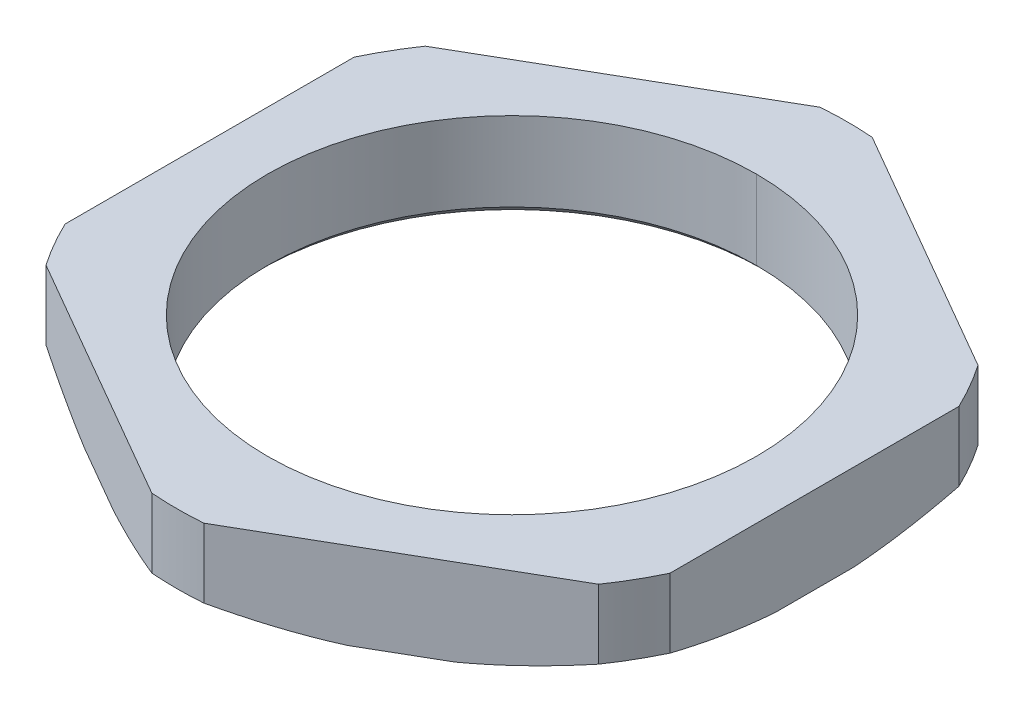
ISO-10303-21;
HEADER;
FILE_DESCRIPTION(('STEP AP214'),'2;1');
FILE_NAME('part.step','',(''),(''),'','','');
FILE_SCHEMA(('AUTOMOTIVE_DESIGN { 1 0 10303 214 1 1 1 1 }'));
ENDSEC;
DATA;
#1=APPLICATION_CONTEXT('core data for automotive mechanical design processes');
#2=APPLICATION_PROTOCOL_DEFINITION('international standard','automotive_design',2000,#1);
#3=PRODUCT_CONTEXT('',#1,'mechanical');
#4=PRODUCT('Part','Part','',(#3));
#5=PRODUCT_RELATED_PRODUCT_CATEGORY('part','',(#4));
#6=PRODUCT_DEFINITION_FORMATION('','',#4);
#7=PRODUCT_DEFINITION_CONTEXT('part definition',#1,'design');
#8=PRODUCT_DEFINITION('design','',#6,#7);
#9=PRODUCT_DEFINITION_SHAPE('','',#8);
#10=(LENGTH_UNIT() NAMED_UNIT(*) SI_UNIT(.MILLI.,.METRE.));
#11=(NAMED_UNIT(*) PLANE_ANGLE_UNIT() SI_UNIT($,.RADIAN.));
#12=(NAMED_UNIT(*) SI_UNIT($,.STERADIAN.) SOLID_ANGLE_UNIT());
#13=UNCERTAINTY_MEASURE_WITH_UNIT(LENGTH_MEASURE(1.E-05),#10,'distance_accuracy_value','');
#14=(GEOMETRIC_REPRESENTATION_CONTEXT(3) GLOBAL_UNCERTAINTY_ASSIGNED_CONTEXT((#13)) GLOBAL_UNIT_ASSIGNED_CONTEXT((#10,
#11,#12)) REPRESENTATION_CONTEXT('',''));
#15=CARTESIAN_POINT('',(0.,0.,0.));
#16=DIRECTION('',(0.,0.,1.));
#17=DIRECTION('',(1.,0.,0.));
#18=AXIS2_PLACEMENT_3D('',#15,#16,#17);
#19=CARTESIAN_POINT('',(0.,-27.1973321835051,0.));
#20=DIRECTION('',(0.,1.,0.));
#21=DIRECTION('',(0.,0.,1.));
#22=AXIS2_PLACEMENT_3D('',#19,#20,#21);
#23=CONICAL_SURFACE('',#22,50.,1.0471975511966);
#24=CARTESIAN_POINT('',(18.3610824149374,-38.6,-24.0402402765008));
#25=CARTESIAN_POINT('',(18.7382562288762,-38.5677652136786,-23.8224494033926));
#26=CARTESIAN_POINT('',(19.1150634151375,-38.5302174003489,-23.6048234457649));
#27=CARTESIAN_POINT('',(19.8688161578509,-38.4446695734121,-23.1695063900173));
#28=CARTESIAN_POINT('',(20.2457593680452,-38.396641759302,-22.9518166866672));
#29=CARTESIAN_POINT('',(21.001058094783,-38.2901413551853,-22.5157462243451));
#30=CARTESIAN_POINT('',(21.3794070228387,-38.2316033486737,-22.2973700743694));
#31=CARTESIAN_POINT('',(22.1386580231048,-38.1041345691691,-21.8591620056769));
#32=CARTESIAN_POINT('',(22.5195477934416,-38.0351057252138,-21.6393373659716));
#33=CARTESIAN_POINT('',(23.273149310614,-37.8889431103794,-21.2042687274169));
#34=CARTESIAN_POINT('',(23.6458862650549,-37.8119748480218,-20.9890126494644));
#35=CARTESIAN_POINT('',(24.3932664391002,-37.6486224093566,-20.5574335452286));
#36=CARTESIAN_POINT('',(24.7678970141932,-37.5621603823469,-20.34111812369));
#37=CARTESIAN_POINT('',(25.5199262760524,-37.3798473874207,-19.9069410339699));
#38=CARTESIAN_POINT('',(25.8973077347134,-37.2839004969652,-19.6890899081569));
#39=CARTESIAN_POINT('',(26.6556216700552,-37.0826361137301,-19.2513414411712));
#40=CARTESIAN_POINT('',(27.0365322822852,-36.9772085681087,-19.031456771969));
#41=CARTESIAN_POINT('',(27.4165967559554,-36.8679491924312,-18.8120366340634));
#42=B_SPLINE_CURVE_WITH_KNOTS('',3,(#24,#25,#26,#27,#28,#29,#30,#31,#32,#33,#34,#35,#36,#37,#38,
#39,#40,#41),.UNSPECIFIED.,.F.,.F.,(4,2,2,2,2,2,2,2,4),(0.,1.31014422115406,2.62380707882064,
3.94594918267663,5.28131229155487,6.59298565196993,7.91635666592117,9.2548364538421,
10.6115906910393),.UNSPECIFIED.);
#43=CARTESIAN_POINT('',(18.3610824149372,-38.6,-24.0402402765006));
#44=VERTEX_POINT('',#43);
#45=CARTESIAN_POINT('',(27.4165967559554,-36.8679491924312,-18.8120366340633));
#46=VERTEX_POINT('',#45);
#47=EDGE_CURVE('E304',#44,#46,#42,.T.);
#48=ORIENTED_EDGE('',*,*,#47,.T.);
#49=CARTESIAN_POINT('',(0.,-36.8679491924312,0.));
#50=DIRECTION('',(0.,-1.,0.));
#51=DIRECTION('',(0.,0.,1.));
#52=AXIS2_PLACEMENT_3D('',#49,#50,#51);
#53=CIRCLE('',#52,33.25);
#54=CARTESIAN_POINT('',(30.,-36.8679491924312,-14.3374509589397));
#55=VERTEX_POINT('',#54);
#56=EDGE_CURVE('E1083',#46,#55,#53,.T.);
#57=ORIENTED_EDGE('',*,*,#56,.T.);
#58=CARTESIAN_POINT('',(30.0000000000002,-36.8679491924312,-14.3374509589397));
#59=CARTESIAN_POINT('',(29.9999914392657,-36.9763099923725,-13.9022042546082));
#60=CARTESIAN_POINT('',(29.9999632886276,-37.080901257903,-13.466008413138));
#61=CARTESIAN_POINT('',(29.9999105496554,-37.2806547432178,-12.5975925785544));
#62=CARTESIAN_POINT('',(29.9998859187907,-37.375924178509,-12.1653972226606));
#63=CARTESIAN_POINT('',(29.999880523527,-37.5570436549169,-11.3040883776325));
#64=CARTESIAN_POINT('',(29.9998992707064,-37.642987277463,-10.8749946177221));
#65=CARTESIAN_POINT('',(29.9999648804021,-37.8054636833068,-10.0189396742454));
#66=CARTESIAN_POINT('',(30.0000114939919,-37.8820726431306,-9.59199296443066));
#67=CARTESIAN_POINT('',(29.9999881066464,-38.0288749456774,-8.72172961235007));
#68=CARTESIAN_POINT('',(29.9999139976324,-38.0987528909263,-8.27835961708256));
#69=CARTESIAN_POINT('',(29.9997833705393,-38.2277496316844,-7.39458875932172));
#70=CARTESIAN_POINT('',(29.9997266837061,-38.2869691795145,-6.95420263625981));
#71=CARTESIAN_POINT('',(29.9997260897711,-38.3946628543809,-6.07501032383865));
#72=CARTESIAN_POINT('',(29.9997814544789,-38.4432041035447,-5.63621237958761));
#73=CARTESIAN_POINT('',(29.9999052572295,-38.5296110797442,-4.75875783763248));
#74=CARTESIAN_POINT('',(29.9999736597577,-38.5675051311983,-4.32010402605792));
#75=CARTESIAN_POINT('',(30.0000000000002,-38.6,-3.88104367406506));
#76=B_SPLINE_CURVE_WITH_KNOTS('',3,(#58,#59,#60,#61,#62,#63,#64,#65,#66,#67,#68,#69,#70,#71,#72,
#73,#74,#75),.UNSPECIFIED.,.F.,.F.,(4,2,2,2,2,2,2,2,4),(0.,1.34559696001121,2.67323460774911,
3.98599636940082,5.28720306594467,6.63362056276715,7.96655250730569,9.29084993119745,
10.611590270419),.UNSPECIFIED.);
#77=CARTESIAN_POINT('',(30.,-38.6,-3.88104367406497));
#78=VERTEX_POINT('',#77);
#79=EDGE_CURVE('E220',#55,#78,#76,.T.);
#80=ORIENTED_EDGE('',*,*,#79,.T.);
#81=CARTESIAN_POINT('',(0.,-38.6,0.));
#82=DIRECTION('',(0.,1.,0.));
#83=DIRECTION('',(0.,0.,1.));
#84=AXIS2_PLACEMENT_3D('',#81,#82,#83);
#85=CIRCLE('',#84,30.25);
#86=EDGE_CURVE('E279',#78,#44,#85,.T.);
#87=ORIENTED_EDGE('',*,*,#86,.T.);
#88=EDGE_LOOP('',(#48,#57,#80,#87));
#89=FACE_BOUND('',#88,.T.);
#90=ADVANCED_FACE('F15',(#89),#23,.T.);
#91=CARTESIAN_POINT('',(0.,-27.1973321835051,0.));
#92=DIRECTION('',(0.,1.,0.));
#93=DIRECTION('',(0.,0.,1.));
#94=AXIS2_PLACEMENT_3D('',#91,#92,#93);
#95=CONICAL_SURFACE('',#94,50.,1.0471975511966);
#96=CARTESIAN_POINT('',(30.0000000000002,-38.6,3.88104367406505));
#97=CARTESIAN_POINT('',(29.9999744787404,-38.5677546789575,4.31672290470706));
#98=CARTESIAN_POINT('',(29.999929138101,-38.5301811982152,4.75200071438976));
#99=CARTESIAN_POINT('',(29.9998713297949,-38.4445478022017,5.62287583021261));
#100=CARTESIAN_POINT('',(29.999858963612,-38.3964560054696,6.05847000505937));
#101=CARTESIAN_POINT('',(29.9999409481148,-38.2897932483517,6.93140181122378));
#102=CARTESIAN_POINT('',(30.0000360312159,-38.2311526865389,7.36873091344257));
#103=CARTESIAN_POINT('',(30.0002158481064,-38.1034459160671,8.24651081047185));
#104=CARTESIAN_POINT('',(30.0003004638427,-38.0342775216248,8.68694670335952));
#105=CARTESIAN_POINT('',(30.0003087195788,-37.8879763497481,9.55757407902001));
#106=CARTESIAN_POINT('',(30.0002354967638,-37.8110272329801,9.98779650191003));
#107=CARTESIAN_POINT('',(30.0001063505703,-37.6477521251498,10.8503016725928));
#108=CARTESIAN_POINT('',(30.0000505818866,-37.5613509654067,11.2825701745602));
#109=CARTESIAN_POINT('',(29.999985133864,-37.379200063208,12.1501461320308));
#110=CARTESIAN_POINT('',(29.999975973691,-37.2833570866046,12.5854339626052));
#111=CARTESIAN_POINT('',(29.9999786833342,-37.082340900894,13.4599694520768));
#112=CARTESIAN_POINT('',(29.999990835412,-36.9770602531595,13.8991924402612));
#113=CARTESIAN_POINT('',(30.0000000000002,-36.8679491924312,14.3374509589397));
#114=B_SPLINE_CURVE_WITH_KNOTS('',3,(#96,#97,#98,#99,#100,#101,#102,#103,#104,#105,#106,#107,
#108,#109,#110,#111,#112,#113),.UNSPECIFIED.,.F.,.F.,(4,2,2,2,2,2,2,2,4),(0.,1.31056980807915,
2.62516846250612,3.9487822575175,5.28617624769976,6.59723374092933,7.91960194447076,
9.25666807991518,10.6115764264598),.UNSPECIFIED.);
#115=CARTESIAN_POINT('',(30.,-38.6,3.88104367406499));
#116=VERTEX_POINT('',#115);
#117=CARTESIAN_POINT('',(30.,-36.8679491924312,14.3374509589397));
#118=VERTEX_POINT('',#117);
#119=EDGE_CURVE('E202',#116,#118,#114,.T.);
#120=ORIENTED_EDGE('',*,*,#119,.T.);
#121=CARTESIAN_POINT('',(0.,-36.8679491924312,0.));
#122=DIRECTION('',(0.,-1.,0.));
#123=DIRECTION('',(0.,0.,1.));
#124=AXIS2_PLACEMENT_3D('',#121,#122,#123);
#125=CIRCLE('',#124,33.25);
#126=CARTESIAN_POINT('',(27.4165967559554,-36.8679491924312,18.8120366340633));
#127=VERTEX_POINT('',#126);
#128=EDGE_CURVE('E187',#118,#127,#125,.T.);
#129=ORIENTED_EDGE('',*,*,#128,.T.);
#130=CARTESIAN_POINT('',(27.4165967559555,-36.8679491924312,18.8120366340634));
#131=CARTESIAN_POINT('',(27.0383482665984,-36.9766864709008,19.0304085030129));
#132=CARTESIAN_POINT('',(26.6592620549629,-37.0816281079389,19.2492409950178));
#133=CARTESIAN_POINT('',(25.9045591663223,-37.2820151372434,19.6849070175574));
#134=CARTESIAN_POINT('',(25.5289640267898,-37.3775688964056,19.9017280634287));
#135=CARTESIAN_POINT('',(24.7804810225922,-37.5591899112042,20.3338586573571));
#136=CARTESIAN_POINT('',(24.4076101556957,-37.6453516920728,20.5491578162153));
#137=CARTESIAN_POINT('',(23.6637361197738,-37.8081976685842,20.9787104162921));
#138=CARTESIAN_POINT('',(23.2927454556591,-37.8849587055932,21.1929563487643));
#139=CARTESIAN_POINT('',(22.5390970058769,-38.0314930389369,21.6280490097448));
#140=CARTESIAN_POINT('',(22.1564006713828,-38.1010139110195,21.8489142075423));
#141=CARTESIAN_POINT('',(21.3935651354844,-38.2293681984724,22.2891884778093));
#142=CARTESIAN_POINT('',(21.0134384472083,-38.2883011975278,22.5085901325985));
#143=CARTESIAN_POINT('',(20.2545975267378,-38.3954933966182,22.9467065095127));
#144=CARTESIAN_POINT('',(19.8758899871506,-38.4438189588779,23.1654165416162));
#145=CARTESIAN_POINT('',(19.1186043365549,-38.5298652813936,23.6027767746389));
#146=CARTESIAN_POINT('',(18.7400285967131,-38.5676141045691,23.8214255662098));
#147=CARTESIAN_POINT('',(18.3610824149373,-38.6,24.0402402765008));
#148=B_SPLINE_CURVE_WITH_KNOTS('',3,(#130,#131,#132,#133,#134,#135,#136,#137,#138,#139,#140,
#141,#142,#143,#144,#145,#146,#147),.UNSPECIFIED.,.F.,.F.,(4,2,2,2,2,2,2,2,4),(0.,
1.35027160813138,2.68245754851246,3.99967535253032,5.30528327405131,6.64705256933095,
7.97545305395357,9.29528964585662,10.6115904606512),.UNSPECIFIED.);
#149=CARTESIAN_POINT('',(18.3610824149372,-38.6,24.0402402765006));
#150=VERTEX_POINT('',#149);
#151=EDGE_CURVE('E453',#127,#150,#148,.T.);
#152=ORIENTED_EDGE('',*,*,#151,.T.);
#153=CARTESIAN_POINT('',(0.,-38.6,0.));
#154=DIRECTION('',(0.,1.,0.));
#155=DIRECTION('',(0.,0.,1.));
#156=AXIS2_PLACEMENT_3D('',#153,#154,#155);
#157=CIRCLE('',#156,30.25);
#158=EDGE_CURVE('E206',#150,#116,#157,.T.);
#159=ORIENTED_EDGE('',*,*,#158,.T.);
#160=EDGE_LOOP('',(#120,#129,#152,#159));
#161=FACE_BOUND('',#160,.T.);
#162=ADVANCED_FACE('F204',(#161),#95,.T.);
#163=CARTESIAN_POINT('',(0.,-27.1973321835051,0.));
#164=DIRECTION('',(0.,1.,0.));
#165=DIRECTION('',(0.,0.,1.));
#166=AXIS2_PLACEMENT_3D('',#163,#164,#165);
#167=CONICAL_SURFACE('',#166,50.,1.0471975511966);
#168=CARTESIAN_POINT('',(2.58340324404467,-36.8679491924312,-33.1494875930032));
#169=CARTESIAN_POINT('',(2.96164307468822,-36.9766864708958,-32.9311007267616));
#170=CARTESIAN_POINT('',(3.34070067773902,-37.0816281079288,-32.7122186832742));
#171=CARTESIAN_POINT('',(4.09534996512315,-37.2820151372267,-32.2764598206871));
#172=CARTESIAN_POINT('',(4.4709200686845,-37.377568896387,-32.0595954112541));
#173=CARTESIAN_POINT('',(5.21939764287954,-37.5591899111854,-31.6274554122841));
#174=CARTESIAN_POINT('',(5.59228761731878,-37.6453516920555,-31.4121893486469));
#175=CARTESIAN_POINT('',(6.33622809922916,-37.8081976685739,-30.9827518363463));
#176=CARTESIAN_POINT('',(6.70726585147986,-37.8849587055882,-30.7685874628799));
#177=CARTESIAN_POINT('',(7.46089137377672,-38.0314930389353,-30.3334550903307));
#178=CARTESIAN_POINT('',(7.8435144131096,-38.1010139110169,-30.1124629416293));
#179=CARTESIAN_POINT('',(8.60622088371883,-38.2293681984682,-29.6719651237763));
#180=CARTESIAN_POINT('',(8.9862916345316,-38.2883011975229,-29.4524665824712));
#181=CARTESIAN_POINT('',(9.74513200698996,-38.3954933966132,-29.0143492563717));
#182=CARTESIAN_POINT('',(10.1238942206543,-38.4438189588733,-28.7957339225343));
#183=CARTESIAN_POINT('',(10.8813021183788,-38.5298652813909,-28.3585854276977));
#184=CARTESIAN_POINT('',(11.2599453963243,-38.5676141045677,-28.1400536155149));
#185=CARTESIAN_POINT('',(11.6389175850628,-38.6,-27.9212839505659));
#186=B_SPLINE_CURVE_WITH_KNOTS('',3,(#168,#169,#170,#171,#172,#173,#174,#175,#176,#177,#178,
#179,#180,#181,#182,#183,#184,#185),.UNSPECIFIED.,.F.,.F.,(4,2,2,2,2,2,2,2,4),(0.,1.35027160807,
2.68245754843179,3.99967535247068,5.3052832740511,6.64705256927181,7.97545305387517,
9.29528964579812,10.6115904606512),.UNSPECIFIED.);
#187=CARTESIAN_POINT('',(2.58340324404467,-36.8679491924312,-33.149487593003));
#188=VERTEX_POINT('',#187);
#189=CARTESIAN_POINT('',(11.6389175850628,-38.6,-27.9212839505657));
#190=VERTEX_POINT('',#189);
#191=EDGE_CURVE('E330',#188,#190,#186,.T.);
#192=ORIENTED_EDGE('',*,*,#191,.T.);
#193=CARTESIAN_POINT('',(0.,-38.6,0.));
#194=DIRECTION('',(0.,1.,0.));
#195=DIRECTION('',(0.,0.,1.));
#196=AXIS2_PLACEMENT_3D('',#193,#194,#195);
#197=CIRCLE('',#196,30.25);
#198=CARTESIAN_POINT('',(-11.6389175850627,-38.6,-27.9212839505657));
#199=VERTEX_POINT('',#198);
#200=EDGE_CURVE('E295',#190,#199,#197,.T.);
#201=ORIENTED_EDGE('',*,*,#200,.T.);
#202=CARTESIAN_POINT('',(-11.6389175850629,-38.6,-27.9212839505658));
#203=CARTESIAN_POINT('',(-11.2617182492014,-38.5677652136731,-28.1390306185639));
#204=CARTESIAN_POINT('',(-10.8848450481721,-38.530217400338,-28.3565422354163));
#205=CARTESIAN_POINT('',(-10.1309730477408,-38.4446695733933,-28.7916527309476));
#206=CARTESIAN_POINT('',(-9.75397662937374,-38.3966417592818,-29.0092502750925));
#207=CARTESIAN_POINT('',(-8.99867916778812,-38.2901413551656,-29.4453229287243));
#208=CARTESIAN_POINT('',(-8.62038541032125,-38.2316033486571,-29.6637946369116));
#209=CARTESIAN_POINT('',(-7.8612605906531,-38.1041345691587,-30.1022212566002));
#210=CARTESIAN_POINT('',(-7.4804419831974,-38.0351057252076,-30.3221691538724));
#211=CARTESIAN_POINT('',(-6.72686073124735,-37.8889431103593,-30.7572728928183));
#212=CARTESIAN_POINT('',(-6.35407502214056,-37.8119748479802,-30.9724445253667));
#213=CARTESIAN_POINT('',(-5.60662646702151,-37.6486224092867,-31.4039051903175));
#214=CARTESIAN_POINT('',(-5.23197652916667,-37.5621603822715,-31.6201870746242));
#215=CARTESIAN_POINT('',(-4.47995350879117,-37.3798473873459,-32.0543749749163));
#216=CARTESIAN_POINT('',(-4.1025981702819,-37.2839004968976,-32.2722713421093));
#217=CARTESIAN_POINT('',(-3.34433990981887,-37.0826361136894,-32.7101162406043));
#218=CARTESIAN_POINT('',(-2.96345889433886,-36.9772085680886,-32.9300521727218));
#219=CARTESIAN_POINT('',(-2.58340324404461,-36.8679491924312,-33.1494875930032));
#220=B_SPLINE_CURVE_WITH_KNOTS('',3,(#202,#203,#204,#205,#206,#207,#208,#209,#210,#211,#212,
#213,#214,#215,#216,#217,#218,#219),.UNSPECIFIED.,.F.,.F.,(4,2,2,2,2,2,2,2,4),(0.,
1.31014422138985,2.62380707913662,3.94594918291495,5.28131229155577,6.59298565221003,
7.91635666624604,9.25483645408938,10.6115906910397),.UNSPECIFIED.);
#221=CARTESIAN_POINT('',(-2.5834032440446,-36.8679491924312,-33.149487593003));
#222=VERTEX_POINT('',#221);
#223=EDGE_CURVE('E372',#199,#222,#220,.T.);
#224=ORIENTED_EDGE('',*,*,#223,.T.);
#225=CARTESIAN_POINT('',(0.,-36.8679491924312,0.));
#226=DIRECTION('',(0.,-1.,0.));
#227=DIRECTION('',(0.,0.,1.));
#228=AXIS2_PLACEMENT_3D('',#225,#226,#227);
#229=CIRCLE('',#228,33.25);
#230=EDGE_CURVE('E287',#222,#188,#229,.T.);
#231=ORIENTED_EDGE('',*,*,#230,.T.);
#232=EDGE_LOOP('',(#192,#201,#224,#231));
#233=FACE_BOUND('',#232,.T.);
#234=ADVANCED_FACE('F342',(#233),#167,.T.);
#235=CARTESIAN_POINT('',(0.,-27.1973321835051,0.));
#236=DIRECTION('',(0.,1.,0.));
#237=DIRECTION('',(0.,0.,1.));
#238=AXIS2_PLACEMENT_3D('',#235,#236,#237);
#239=CONICAL_SURFACE('',#238,50.,1.0471975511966);
#240=CARTESIAN_POINT('',(-27.4165967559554,-36.8679491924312,-18.8120366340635));
#241=CARTESIAN_POINT('',(-27.0383482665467,-36.9766864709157,-19.0304085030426));
#242=CARTESIAN_POINT('',(-26.6592620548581,-37.0816281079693,-19.2492409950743));
#243=CARTESIAN_POINT('',(-25.9045591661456,-37.2820151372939,-19.6849070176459));
#244=CARTESIAN_POINT('',(-25.5289640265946,-37.3775688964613,-19.9017280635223));
#245=CARTESIAN_POINT('',(-24.780481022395,-37.5591899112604,-20.3338586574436));
#246=CARTESIAN_POINT('',(-24.4076101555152,-37.6453516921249,-20.5491578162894));
#247=CARTESIAN_POINT('',(-23.6637361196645,-37.8081976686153,-20.9787104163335));
#248=CARTESIAN_POINT('',(-23.2927454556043,-37.8849587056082,-21.192956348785));
#249=CARTESIAN_POINT('',(-22.5390970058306,-38.0314930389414,-21.6280490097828));
#250=CARTESIAN_POINT('',(-22.1564006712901,-38.1010139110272,-21.8489142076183));
#251=CARTESIAN_POINT('',(-21.3935651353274,-38.2293681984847,-22.2891884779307));
#252=CARTESIAN_POINT('',(-21.0134384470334,-38.2883011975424,-22.5085901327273));
#253=CARTESIAN_POINT('',(-20.2545975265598,-38.3954933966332,-22.9467065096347));
#254=CARTESIAN_POINT('',(-19.8758899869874,-38.4438189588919,-23.165416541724));
#255=CARTESIAN_POINT('',(-19.1186043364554,-38.5298652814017,-23.6027767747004));
#256=CARTESIAN_POINT('',(-18.7400285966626,-38.5676141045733,-23.8214255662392));
#257=CARTESIAN_POINT('',(-18.3610824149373,-38.6,-24.0402402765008));
#258=B_SPLINE_CURVE_WITH_KNOTS('',3,(#240,#241,#242,#243,#244,#245,#246,#247,#248,#249,#250,
#251,#252,#253,#254,#255,#256,#257),.UNSPECIFIED.,.F.,.F.,(4,2,2,2,2,2,2,2,4),(0.,
1.3502716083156,2.68245754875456,3.99967535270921,5.3052832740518,6.64705256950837,
7.97545305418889,9.29528964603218,10.611590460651),.UNSPECIFIED.);
#259=CARTESIAN_POINT('',(-27.4165967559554,-36.8679491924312,-18.8120366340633));
#260=VERTEX_POINT('',#259);
#261=CARTESIAN_POINT('',(-18.3610824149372,-38.6,-24.0402402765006));
#262=VERTEX_POINT('',#261);
#263=EDGE_CURVE('E198',#260,#262,#258,.T.);
#264=ORIENTED_EDGE('',*,*,#263,.T.);
#265=CARTESIAN_POINT('',(0.,-38.6,0.));
#266=DIRECTION('',(0.,1.,0.));
#267=DIRECTION('',(0.,0.,1.));
#268=AXIS2_PLACEMENT_3D('',#265,#266,#267);
#269=CIRCLE('',#268,30.25);
#270=CARTESIAN_POINT('',(-30.,-38.6,-3.88104367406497));
#271=VERTEX_POINT('',#270);
#272=EDGE_CURVE('E684',#262,#271,#269,.T.);
#273=ORIENTED_EDGE('',*,*,#272,.T.);
#274=CARTESIAN_POINT('',(-30.0000000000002,-38.6,-3.88104367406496));
#275=CARTESIAN_POINT('',(-29.9999744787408,-38.5677546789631,-4.31672290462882));
#276=CARTESIAN_POINT('',(-29.9999291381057,-38.530181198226,-4.75200071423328));
#277=CARTESIAN_POINT('',(-29.9998713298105,-38.4445478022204,-5.62287582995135));
#278=CARTESIAN_POINT('',(-29.9998589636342,-38.3964560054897,-6.05847000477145));
#279=CARTESIAN_POINT('',(-29.999940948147,-38.2897932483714,-6.93140181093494));
#280=CARTESIAN_POINT('',(-30.0000360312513,-38.2311526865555,-7.36873091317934));
#281=CARTESIAN_POINT('',(-30.0002158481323,-38.1034459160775,-8.2465108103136));
#282=CARTESIAN_POINT('',(-30.0003004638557,-38.0342775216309,-8.68694670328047));
#283=CARTESIAN_POINT('',(-30.000308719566,-37.8879763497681,-9.55757407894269));
#284=CARTESIAN_POINT('',(-30.0002354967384,-37.8110272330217,-9.98779650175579));
#285=CARTESIAN_POINT('',(-30.0001063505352,-37.6477521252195,-10.8503016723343));
#286=CARTESIAN_POINT('',(-30.0000505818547,-37.5613509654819,-11.2825701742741));
#287=CARTESIAN_POINT('',(-29.9999851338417,-37.3792000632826,-12.1501461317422));
#288=CARTESIAN_POINT('',(-29.9999759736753,-37.283357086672,-12.5854339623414));
#289=CARTESIAN_POINT('',(-29.9999786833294,-37.0823409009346,-13.4599694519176));
#290=CARTESIAN_POINT('',(-29.9999908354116,-36.9770602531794,-13.8991924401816));
#291=CARTESIAN_POINT('',(-30.0000000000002,-36.8679491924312,-14.3374509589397));
#292=B_SPLINE_CURVE_WITH_KNOTS('',3,(#274,#275,#276,#277,#278,#279,#280,#281,#282,#283,#284,
#285,#286,#287,#288,#289,#290,#291),.UNSPECIFIED.,.F.,.F.,(4,2,2,2,2,2,2,2,4),(0.,
1.31056980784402,2.62516846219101,3.94878225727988,5.28617624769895,6.59723374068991,
7.91960194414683,9.25666807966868,10.6115764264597),.UNSPECIFIED.);
#293=CARTESIAN_POINT('',(-30.,-36.8679491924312,-14.3374509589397));
#294=VERTEX_POINT('',#293);
#295=EDGE_CURVE('E691',#271,#294,#292,.T.);
#296=ORIENTED_EDGE('',*,*,#295,.T.);
#297=CARTESIAN_POINT('',(0.,-36.8679491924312,0.));
#298=DIRECTION('',(0.,-1.,0.));
#299=DIRECTION('',(0.,0.,1.));
#300=AXIS2_PLACEMENT_3D('',#297,#298,#299);
#301=CIRCLE('',#300,33.25);
#302=EDGE_CURVE('E665',#294,#260,#301,.T.);
#303=ORIENTED_EDGE('',*,*,#302,.T.);
#304=EDGE_LOOP('',(#264,#273,#296,#303));
#305=FACE_BOUND('',#304,.T.);
#306=ADVANCED_FACE('F351',(#305),#239,.T.);
#307=CARTESIAN_POINT('',(0.,-27.1973321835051,0.));
#308=DIRECTION('',(0.,1.,0.));
#309=DIRECTION('',(0.,0.,1.));
#310=AXIS2_PLACEMENT_3D('',#307,#308,#309);
#311=CONICAL_SURFACE('',#310,50.,1.0471975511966);
#312=DIRECTION('',(0.,0.5,0.866025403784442));
#313=VECTOR('',#312,1.);
#314=CARTESIAN_POINT('',(0.,-27.1973321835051,50.));
#315=LINE('',#314,#313);
#316=CARTESIAN_POINT('',(0.,-38.6,30.25));
#317=VERTEX_POINT('',#316);
#318=CARTESIAN_POINT('',(0.,-36.8679491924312,33.25));
#319=VERTEX_POINT('',#318);
#320=EDGE_CURVE('E503',#317,#319,#315,.T.);
#321=ORIENTED_EDGE('',*,*,#320,.F.);
#322=CARTESIAN_POINT('',(0.,-38.6,0.));
#323=DIRECTION('',(0.,1.,0.));
#324=DIRECTION('',(0.,0.,1.));
#325=AXIS2_PLACEMENT_3D('',#322,#323,#324);
#326=CIRCLE('',#325,30.25);
#327=CARTESIAN_POINT('',(11.6389175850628,-38.6,27.9212839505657));
#328=VERTEX_POINT('',#327);
#329=EDGE_CURVE('E471',#317,#328,#326,.T.);
#330=ORIENTED_EDGE('',*,*,#329,.T.);
#331=CARTESIAN_POINT('',(11.6389175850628,-38.6,27.9212839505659));
#332=CARTESIAN_POINT('',(11.2617182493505,-38.5677652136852,28.1390306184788));
#333=CARTESIAN_POINT('',(10.8848450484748,-38.5302174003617,28.3565422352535));
#334=CARTESIAN_POINT('',(10.1309730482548,-38.4446695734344,28.7916527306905));
#335=CARTESIAN_POINT('',(9.7539766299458,-38.396641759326,29.0092502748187));
#336=CARTESIAN_POINT('',(8.99867916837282,-38.2901413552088,29.4453229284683));
#337=CARTESIAN_POINT('',(8.62038541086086,-38.2316033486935,29.6637946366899));
#338=CARTESIAN_POINT('',(7.86126059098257,-38.1041345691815,30.1022212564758));
#339=CARTESIAN_POINT('',(7.48044198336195,-38.0351057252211,30.3221691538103));
#340=CARTESIAN_POINT('',(6.7268607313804,-37.8889431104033,30.7572728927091));
#341=CARTESIAN_POINT('',(6.35407502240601,-37.8119748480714,30.9724445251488));
#342=CARTESIAN_POINT('',(5.60662646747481,-37.6486224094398,31.4039051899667));
#343=CARTESIAN_POINT('',(5.23197652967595,-37.5621603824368,31.6201870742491));
#344=CARTESIAN_POINT('',(4.4799535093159,-37.3798473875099,32.0543749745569));
#345=CARTESIAN_POINT('',(4.10259817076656,-37.2839004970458,32.2722713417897));
#346=CARTESIAN_POINT('',(3.34433991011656,-37.0826361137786,32.7101162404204));
#347=CARTESIAN_POINT('',(2.96345889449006,-36.9772085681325,32.9300521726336));
#348=CARTESIAN_POINT('',(2.58340324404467,-36.8679491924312,33.1494875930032));
#349=B_SPLINE_CURVE_WITH_KNOTS('',3,(#331,#332,#333,#334,#335,#336,#337,#338,#339,#340,#341,
#342,#343,#344,#345,#346,#347,#348),.UNSPECIFIED.,.F.,.F.,(4,2,2,2,2,2,2,2,4),(0.,
1.31014422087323,2.62380707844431,3.9459491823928,5.28131229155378,6.59298565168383,
7.91635666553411,9.25483645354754,10.6115906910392),.UNSPECIFIED.);
#350=CARTESIAN_POINT('',(2.58340324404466,-36.8679491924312,33.149487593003));
#351=VERTEX_POINT('',#350);
#352=EDGE_CURVE('E199',#328,#351,#349,.T.);
#353=ORIENTED_EDGE('',*,*,#352,.T.);
#354=CARTESIAN_POINT('',(0.,-36.8679491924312,0.));
#355=DIRECTION('',(0.,-1.,0.));
#356=DIRECTION('',(0.,0.,1.));
#357=AXIS2_PLACEMENT_3D('',#354,#355,#356);
#358=CIRCLE('',#357,33.25);
#359=EDGE_CURVE('E212',#351,#319,#358,.T.);
#360=ORIENTED_EDGE('',*,*,#359,.T.);
#361=EDGE_LOOP('',(#321,#330,#353,#360));
#362=FACE_BOUND('',#361,.T.);
#363=ADVANCED_FACE('F417',(#362),#311,.T.);
#364=CARTESIAN_POINT('',(0.,-27.1973321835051,0.));
#365=DIRECTION('',(0.,1.,0.));
#366=DIRECTION('',(0.,0.,1.));
#367=AXIS2_PLACEMENT_3D('',#364,#365,#366);
#368=CONICAL_SURFACE('',#367,50.,1.0471975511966);
#369=CARTESIAN_POINT('',(-30.0000000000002,-36.8679491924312,14.3374509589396));
#370=CARTESIAN_POINT('',(-29.9999914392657,-36.9763099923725,13.9022042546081));
#371=CARTESIAN_POINT('',(-29.9999632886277,-37.080901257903,13.4660084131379));
#372=CARTESIAN_POINT('',(-29.9999105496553,-37.2806547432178,12.5975925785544));
#373=CARTESIAN_POINT('',(-29.9998859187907,-37.375924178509,12.1653972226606));
#374=CARTESIAN_POINT('',(-29.999880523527,-37.5570436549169,11.3040883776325));
#375=CARTESIAN_POINT('',(-29.9998992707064,-37.642987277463,10.8749946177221));
#376=CARTESIAN_POINT('',(-29.9999648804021,-37.8054636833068,10.0189396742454));
#377=CARTESIAN_POINT('',(-30.0000114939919,-37.8820726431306,9.5919929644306));
#378=CARTESIAN_POINT('',(-29.9999881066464,-38.0288749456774,8.72172961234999));
#379=CARTESIAN_POINT('',(-29.9999139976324,-38.0987528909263,8.27835961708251));
#380=CARTESIAN_POINT('',(-29.9997833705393,-38.2277496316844,7.3945887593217));
#381=CARTESIAN_POINT('',(-29.9997266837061,-38.2869691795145,6.95420263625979));
#382=CARTESIAN_POINT('',(-29.9997260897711,-38.3946628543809,6.07501032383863));
#383=CARTESIAN_POINT('',(-29.9997814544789,-38.4432041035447,5.63621237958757));
#384=CARTESIAN_POINT('',(-29.9999052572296,-38.5296110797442,4.75875783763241));
#385=CARTESIAN_POINT('',(-29.9999736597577,-38.5675051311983,4.32010402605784));
#386=CARTESIAN_POINT('',(-30.0000000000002,-38.6,3.88104367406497));
#387=B_SPLINE_CURVE_WITH_KNOTS('',3,(#369,#370,#371,#372,#373,#374,#375,#376,#377,#378,#379,
#380,#381,#382,#383,#384,#385,#386),.UNSPECIFIED.,.F.,.F.,(4,2,2,2,2,2,2,2,4),(0.,
1.34559696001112,2.67323460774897,3.98599636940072,5.28720306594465,6.63362056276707,
7.96655250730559,9.2908499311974,10.6115902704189),.UNSPECIFIED.);
#388=CARTESIAN_POINT('',(-30.,-36.8679491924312,14.3374509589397));
#389=VERTEX_POINT('',#388);
#390=CARTESIAN_POINT('',(-30.,-38.6,3.88104367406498));
#391=VERTEX_POINT('',#390);
#392=EDGE_CURVE('E676',#389,#391,#387,.T.);
#393=ORIENTED_EDGE('',*,*,#392,.T.);
#394=CARTESIAN_POINT('',(0.,-38.6,0.));
#395=DIRECTION('',(0.,1.,0.));
#396=DIRECTION('',(0.,0.,1.));
#397=AXIS2_PLACEMENT_3D('',#394,#395,#396);
#398=CIRCLE('',#397,30.25);
#399=CARTESIAN_POINT('',(-18.3610824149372,-38.6,24.0402402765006));
#400=VERTEX_POINT('',#399);
#401=EDGE_CURVE('E613',#391,#400,#398,.T.);
#402=ORIENTED_EDGE('',*,*,#401,.T.);
#403=CARTESIAN_POINT('',(-18.3610824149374,-38.6,24.0402402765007));
#404=CARTESIAN_POINT('',(-18.7382562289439,-38.5677652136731,23.8224494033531));
#405=CARTESIAN_POINT('',(-19.1150634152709,-38.530217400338,23.6048234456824));
#406=CARTESIAN_POINT('',(-19.8688161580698,-38.4446695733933,23.1695063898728));
#407=CARTESIAN_POINT('',(-20.2457593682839,-38.3966417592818,22.9518166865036));
#408=CARTESIAN_POINT('',(-21.0010580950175,-38.2901413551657,22.5157462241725));
#409=CARTESIAN_POINT('',(-21.3794070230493,-38.2316033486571,22.2973700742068));
#410=CARTESIAN_POINT('',(-22.1386580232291,-38.1041345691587,21.8591620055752));
#411=CARTESIAN_POINT('',(-22.5195477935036,-38.0351057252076,21.6393373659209));
#412=CARTESIAN_POINT('',(-23.2731493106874,-37.8889431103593,21.2042687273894));
#413=CARTESIAN_POINT('',(-23.6458862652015,-37.8119748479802,20.9890126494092));
#414=CARTESIAN_POINT('',(-24.3932664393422,-37.6486224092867,20.5574335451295));
#415=CARTESIAN_POINT('',(-24.7678970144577,-37.5621603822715,20.3411181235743));
#416=CARTESIAN_POINT('',(-25.5199262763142,-37.3798473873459,19.9069410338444));
#417=CARTESIAN_POINT('',(-25.8973077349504,-37.2839004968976,19.6890899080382));
#418=CARTESIAN_POINT('',(-26.6556216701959,-37.0826361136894,19.2513414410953));
#419=CARTESIAN_POINT('',(-27.0365322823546,-36.9772085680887,19.0314567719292));
#420=CARTESIAN_POINT('',(-27.4165967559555,-36.8679491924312,18.8120366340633));
#421=B_SPLINE_CURVE_WITH_KNOTS('',3,(#403,#404,#405,#406,#407,#408,#409,#410,#411,#412,#413,
#414,#415,#416,#417,#418,#419,#420),.UNSPECIFIED.,.F.,.F.,(4,2,2,2,2,2,2,2,4),(0.,
1.31014422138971,2.62380707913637,3.94594918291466,5.28131229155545,6.59298565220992,
7.91635666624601,9.25483645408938,10.6115906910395),.UNSPECIFIED.);
#422=CARTESIAN_POINT('',(-27.4165967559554,-36.8679491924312,18.8120366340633));
#423=VERTEX_POINT('',#422);
#424=EDGE_CURVE('E597',#400,#423,#421,.T.);
#425=ORIENTED_EDGE('',*,*,#424,.T.);
#426=CARTESIAN_POINT('',(0.,-36.8679491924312,0.));
#427=DIRECTION('',(0.,-1.,0.));
#428=DIRECTION('',(0.,0.,1.));
#429=AXIS2_PLACEMENT_3D('',#426,#427,#428);
#430=CIRCLE('',#429,33.25);
#431=EDGE_CURVE('E26',#423,#389,#430,.T.);
#432=ORIENTED_EDGE('',*,*,#431,.T.);
#433=EDGE_LOOP('',(#393,#402,#425,#432));
#434=FACE_BOUND('',#433,.T.);
#435=ADVANCED_FACE('F426',(#434),#368,.T.);
#436=CARTESIAN_POINT('',(0.,-37.85,0.));
#437=DIRECTION('',(0.,-1.,0.));
#438=DIRECTION('',(0.,0.,-1.));
#439=AXIS2_PLACEMENT_3D('',#436,#437,#438);
#440=CONICAL_SURFACE('',#439,24.25,0.785398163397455);
#441=DIRECTION('',(0.,-0.707106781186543,0.707106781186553));
#442=VECTOR('',#441,1.);
#443=CARTESIAN_POINT('',(0.,-37.85,24.25));
#444=LINE('',#443,#442);
#445=CARTESIAN_POINT('',(0.,-37.85,24.25));
#446=VERTEX_POINT('',#445);
#447=CARTESIAN_POINT('',(0.,-38.6,25.));
#448=VERTEX_POINT('',#447);
#449=EDGE_CURVE('E536',#446,#448,#444,.T.);
#450=ORIENTED_EDGE('',*,*,#449,.F.);
#451=CARTESIAN_POINT('',(0.,-37.85,0.));
#452=DIRECTION('',(0.,-1.,0.));
#453=DIRECTION('',(0.,0.,1.));
#454=AXIS2_PLACEMENT_3D('',#451,#452,#453);
#455=CIRCLE('',#454,24.25);
#456=CARTESIAN_POINT('',(0.,-37.85,-24.25));
#457=VERTEX_POINT('',#456);
#458=EDGE_CURVE('E10',#457,#446,#455,.T.);
#459=ORIENTED_EDGE('',*,*,#458,.F.);
#460=DIRECTION('',(0.,-0.707106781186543,-0.707106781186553));
#461=VECTOR('',#460,1.);
#462=CARTESIAN_POINT('',(0.,-37.85,-24.25));
#463=LINE('',#462,#461);
#464=CARTESIAN_POINT('',(0.,-38.6,-25.));
#465=VERTEX_POINT('',#464);
#466=EDGE_CURVE('E545',#457,#465,#463,.T.);
#467=ORIENTED_EDGE('',*,*,#466,.T.);
#468=CARTESIAN_POINT('',(0.,-38.6,0.));
#469=DIRECTION('',(0.,1.,0.));
#470=DIRECTION('',(0.,0.,1.));
#471=AXIS2_PLACEMENT_3D('',#468,#469,#470);
#472=CIRCLE('',#471,25.);
#473=EDGE_CURVE('E278',#448,#465,#472,.T.);
#474=ORIENTED_EDGE('',*,*,#473,.F.);
#475=EDGE_LOOP('',(#450,#459,#467,#474));
#476=FACE_BOUND('',#475,.T.);
#477=ADVANCED_FACE('F807',(#476),#440,.F.);
#478=CARTESIAN_POINT('',(0.,-38.6,0.));
#479=DIRECTION('',(0.,1.,0.));
#480=DIRECTION('',(0.,0.,1.));
#481=AXIS2_PLACEMENT_3D('',#478,#479,#480);
#482=CYLINDRICAL_SURFACE('',#481,24.25);
#483=DIRECTION('',(0.,1.,0.));
#484=VECTOR('',#483,1.);
#485=CARTESIAN_POINT('',(0.,-38.6,-24.25));
#486=LINE('',#485,#484);
#487=CARTESIAN_POINT('',(0.,-30.,-24.25));
#488=VERTEX_POINT('',#487);
#489=EDGE_CURVE('E546',#457,#488,#486,.T.);
#490=ORIENTED_EDGE('',*,*,#489,.F.);
#491=ORIENTED_EDGE('',*,*,#458,.T.);
#492=DIRECTION('',(0.,1.,0.));
#493=VECTOR('',#492,1.);
#494=CARTESIAN_POINT('',(0.,-38.6,24.25));
#495=LINE('',#494,#493);
#496=CARTESIAN_POINT('',(0.,-30.,24.25));
#497=VERTEX_POINT('',#496);
#498=EDGE_CURVE('E554',#446,#497,#495,.T.);
#499=ORIENTED_EDGE('',*,*,#498,.T.);
#500=CARTESIAN_POINT('',(0.,-30.,0.));
#501=DIRECTION('',(0.,1.,0.));
#502=DIRECTION('',(0.,0.,1.));
#503=AXIS2_PLACEMENT_3D('',#500,#501,#502);
#504=CIRCLE('',#503,24.25);
#505=EDGE_CURVE('E591',#497,#488,#504,.T.);
#506=ORIENTED_EDGE('',*,*,#505,.T.);
#507=EDGE_LOOP('',(#490,#491,#499,#506));
#508=FACE_BOUND('',#507,.T.);
#509=ADVANCED_FACE('F855',(#508),#482,.F.);
#510=CARTESIAN_POINT('',(0.,-38.6,0.));
#511=DIRECTION('',(0.,1.,0.));
#512=DIRECTION('',(0.,0.,-1.));
#513=AXIS2_PLACEMENT_3D('',#510,#511,#512);
#514=CYLINDRICAL_SURFACE('',#513,33.25);
#515=ORIENTED_EDGE('',*,*,#431,.F.);
#516=DIRECTION('',(0.,1.,0.));
#517=VECTOR('',#516,1.);
#518=CARTESIAN_POINT('',(-27.4165967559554,-38.6,18.8120366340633));
#519=LINE('',#518,#517);
#520=CARTESIAN_POINT('',(-27.4165967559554,-30.,18.8120366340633));
#521=VERTEX_POINT('',#520);
#522=EDGE_CURVE('E694',#423,#521,#519,.T.);
#523=ORIENTED_EDGE('',*,*,#522,.T.);
#524=CARTESIAN_POINT('',(0.,-30.,0.));
#525=DIRECTION('',(0.,-1.,0.));
#526=DIRECTION('',(0.,0.,-1.));
#527=AXIS2_PLACEMENT_3D('',#524,#525,#526);
#528=CIRCLE('',#527,33.25);
#529=CARTESIAN_POINT('',(-30.,-30.,14.3374509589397));
#530=VERTEX_POINT('',#529);
#531=EDGE_CURVE('E527',#521,#530,#528,.T.);
#532=ORIENTED_EDGE('',*,*,#531,.T.);
#533=DIRECTION('',(0.,1.,0.));
#534=VECTOR('',#533,1.);
#535=CARTESIAN_POINT('',(-30.,-38.6,14.3374509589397));
#536=LINE('',#535,#534);
#537=EDGE_CURVE('E695',#389,#530,#536,.T.);
#538=ORIENTED_EDGE('',*,*,#537,.F.);
#539=EDGE_LOOP('',(#515,#523,#532,#538));
#540=FACE_BOUND('',#539,.T.);
#541=ADVANCED_FACE('F624',(#540),#514,.T.);
#542=CARTESIAN_POINT('',(-27.4165967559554,-38.6,18.8120366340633));
#543=DIRECTION('',(0.5,0.,-0.866025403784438));
#544=DIRECTION('',(0.,1.,0.));
#545=AXIS2_PLACEMENT_3D('',#542,#543,#544);
#546=PLANE('',#545);
#547=CARTESIAN_POINT('',(-2.58340324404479,-36.8679491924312,33.1494875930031));
#548=CARTESIAN_POINT('',(-2.96164307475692,-36.9766864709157,32.9311007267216));
#549=CARTESIAN_POINT('',(-3.3407006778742,-37.0816281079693,32.7122186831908));
#550=CARTESIAN_POINT('',(-4.09534996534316,-37.2820151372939,32.2764598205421));
#551=CARTESIAN_POINT('',(-4.47092006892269,-37.3775688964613,32.0595954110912));
#552=CARTESIAN_POINT('',(-5.21939764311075,-37.5591899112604,31.6274554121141));
#553=CARTESIAN_POINT('',(-5.59228761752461,-37.6453516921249,31.4121893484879));
#554=CARTESIAN_POINT('',(-6.33622809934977,-37.8081976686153,30.9827518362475));
#555=CARTESIAN_POINT('',(-6.70726585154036,-37.8849587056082,30.7685874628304));
#556=CARTESIAN_POINT('',(-7.46089137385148,-38.0314930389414,30.3334550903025));
#557=CARTESIAN_POINT('',(-7.84351441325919,-38.1010139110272,30.112462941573));
#558=CARTESIAN_POINT('',(-8.60622088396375,-38.2293681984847,29.6719651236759));
#559=CARTESIAN_POINT('',(-8.98629163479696,-38.2883011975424,29.4524665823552));
#560=CARTESIAN_POINT('',(-9.74513200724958,-38.3954933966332,29.0143492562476));
#561=CARTESIAN_POINT('',(-10.1238942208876,-38.4438189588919,28.7957339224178));
#562=CARTESIAN_POINT('',(-10.8813021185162,-38.5298652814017,28.3585854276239));
#563=CARTESIAN_POINT('',(-11.259945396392,-38.5676141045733,28.1400536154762));
#564=CARTESIAN_POINT('',(-11.6389175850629,-38.6,27.9212839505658));
#565=B_SPLINE_CURVE_WITH_KNOTS('',3,(#547,#548,#549,#550,#551,#552,#553,#554,#555,#556,#557,
#558,#559,#560,#561,#562,#563,#564),.UNSPECIFIED.,.F.,.F.,(4,2,2,2,2,2,2,2,4),(0.,
1.3502716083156,2.68245754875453,3.99967535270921,5.30528327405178,6.64705256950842,
7.97545305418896,9.29528964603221,10.611590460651),.UNSPECIFIED.);
#566=CARTESIAN_POINT('',(-2.58340324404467,-36.8679491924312,33.149487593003));
#567=VERTEX_POINT('',#566);
#568=CARTESIAN_POINT('',(-11.6389175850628,-38.6,27.9212839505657));
#569=VERTEX_POINT('',#568);
#570=EDGE_CURVE('E513',#567,#569,#565,.T.);
#571=ORIENTED_EDGE('',*,*,#570,.F.);
#572=DIRECTION('',(0.,1.,0.));
#573=VECTOR('',#572,1.);
#574=CARTESIAN_POINT('',(-2.58340324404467,-38.6,33.149487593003));
#575=LINE('',#574,#573);
#576=CARTESIAN_POINT('',(-2.58340324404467,-30.,33.149487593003));
#577=VERTEX_POINT('',#576);
#578=EDGE_CURVE('E490',#567,#577,#575,.T.);
#579=ORIENTED_EDGE('',*,*,#578,.T.);
#580=DIRECTION('',(-0.866025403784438,0.,-0.5));
#581=VECTOR('',#580,1.);
#582=CARTESIAN_POINT('',(-27.4165967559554,-30.,18.8120366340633));
#583=LINE('',#582,#581);
#584=EDGE_CURVE('E531',#577,#521,#583,.T.);
#585=ORIENTED_EDGE('',*,*,#584,.T.);
#586=ORIENTED_EDGE('',*,*,#522,.F.);
#587=ORIENTED_EDGE('',*,*,#424,.F.);
#588=DIRECTION('',(-0.866025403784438,0.,-0.5));
#589=VECTOR('',#588,1.);
#590=CARTESIAN_POINT('',(-27.4165967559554,-38.6,18.8120366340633));
#591=LINE('',#590,#589);
#592=EDGE_CURVE('E479',#569,#400,#591,.T.);
#593=ORIENTED_EDGE('',*,*,#592,.F.);
#594=EDGE_LOOP('',(#571,#579,#585,#586,#587,#593));
#595=FACE_BOUND('',#594,.T.);
#596=ADVANCED_FACE('F615',(#595),#546,.F.);
#597=CARTESIAN_POINT('',(-30.,-38.6,-14.3374509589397));
#598=DIRECTION('',(1.,0.,0.));
#599=DIRECTION('',(0.,0.,-1.));
#600=AXIS2_PLACEMENT_3D('',#597,#598,#599);
#601=PLANE('',#600);
#602=ORIENTED_EDGE('',*,*,#392,.F.);
#603=ORIENTED_EDGE('',*,*,#537,.T.);
#604=DIRECTION('',(0.,0.,1.));
#605=VECTOR('',#604,1.);
#606=CARTESIAN_POINT('',(-30.,-30.,-14.3374509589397));
#607=LINE('',#606,#605);
#608=CARTESIAN_POINT('',(-30.,-30.,-14.3374509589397));
#609=VERTEX_POINT('',#608);
#610=EDGE_CURVE('E532',#609,#530,#607,.T.);
#611=ORIENTED_EDGE('',*,*,#610,.F.);
#612=DIRECTION('',(0.,1.,0.));
#613=VECTOR('',#612,1.);
#614=CARTESIAN_POINT('',(-30.,-38.6,-14.3374509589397));
#615=LINE('',#614,#613);
#616=EDGE_CURVE('E668',#294,#609,#615,.T.);
#617=ORIENTED_EDGE('',*,*,#616,.F.);
#618=ORIENTED_EDGE('',*,*,#295,.F.);
#619=DIRECTION('',(0.,0.,1.));
#620=VECTOR('',#619,1.);
#621=CARTESIAN_POINT('',(-30.,-38.6,-14.3374509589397));
#622=LINE('',#621,#620);
#623=EDGE_CURVE('E680',#271,#391,#622,.T.);
#624=ORIENTED_EDGE('',*,*,#623,.T.);
#625=EDGE_LOOP('',(#602,#603,#611,#617,#618,#624));
#626=FACE_BOUND('',#625,.T.);
#627=ADVANCED_FACE('F352',(#626),#601,.F.);
#628=CARTESIAN_POINT('',(0.,-38.6,0.));
#629=DIRECTION('',(0.,1.,0.));
#630=DIRECTION('',(0.,0.,1.));
#631=AXIS2_PLACEMENT_3D('',#628,#629,#630);
#632=CYLINDRICAL_SURFACE('',#631,33.25);
#633=ORIENTED_EDGE('',*,*,#302,.F.);
#634=ORIENTED_EDGE('',*,*,#616,.T.);
#635=CARTESIAN_POINT('',(0.,-30.,0.));
#636=DIRECTION('',(0.,1.,0.));
#637=DIRECTION('',(0.,0.,1.));
#638=AXIS2_PLACEMENT_3D('',#635,#636,#637);
#639=CIRCLE('',#638,33.25);
#640=CARTESIAN_POINT('',(-27.4165967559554,-30.,-18.8120366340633));
#641=VERTEX_POINT('',#640);
#642=EDGE_CURVE('E525',#641,#609,#639,.T.);
#643=ORIENTED_EDGE('',*,*,#642,.F.);
#644=DIRECTION('',(0.,1.,0.));
#645=VECTOR('',#644,1.);
#646=CARTESIAN_POINT('',(-27.4165967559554,-38.6,-18.8120366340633));
#647=LINE('',#646,#645);
#648=EDGE_CURVE('E397',#260,#641,#647,.T.);
#649=ORIENTED_EDGE('',*,*,#648,.F.);
#650=EDGE_LOOP('',(#633,#634,#643,#649));
#651=FACE_BOUND('',#650,.T.);
#652=ADVANCED_FACE('F386',(#651),#632,.T.);
#653=CARTESIAN_POINT('',(-27.4165967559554,-38.6,-18.8120366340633));
#654=DIRECTION('',(0.5,0.,0.866025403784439));
#655=DIRECTION('',(0.,-1.,0.));
#656=AXIS2_PLACEMENT_3D('',#653,#654,#655);
#657=PLANE('',#656);
#658=ORIENTED_EDGE('',*,*,#263,.F.);
#659=ORIENTED_EDGE('',*,*,#648,.T.);
#660=DIRECTION('',(-0.866025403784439,0.,0.5));
#661=VECTOR('',#660,1.);
#662=CARTESIAN_POINT('',(-27.4165967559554,-30.,-18.8120366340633));
#663=LINE('',#662,#661);
#664=CARTESIAN_POINT('',(-2.58340324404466,-30.,-33.149487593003));
#665=VERTEX_POINT('',#664);
#666=EDGE_CURVE('E562',#665,#641,#663,.T.);
#667=ORIENTED_EDGE('',*,*,#666,.F.);
#668=DIRECTION('',(0.,1.,0.));
#669=VECTOR('',#668,1.);
#670=CARTESIAN_POINT('',(-2.58340324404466,-38.6,-33.149487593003));
#671=LINE('',#670,#669);
#672=EDGE_CURVE('E1091',#222,#665,#671,.T.);
#673=ORIENTED_EDGE('',*,*,#672,.F.);
#674=ORIENTED_EDGE('',*,*,#223,.F.);
#675=DIRECTION('',(-0.866025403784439,0.,0.5));
#676=VECTOR('',#675,1.);
#677=CARTESIAN_POINT('',(-27.4165967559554,-38.6,-18.8120366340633));
#678=LINE('',#677,#676);
#679=EDGE_CURVE('E689',#199,#262,#678,.T.);
#680=ORIENTED_EDGE('',*,*,#679,.T.);
#681=EDGE_LOOP('',(#658,#659,#667,#673,#674,#680));
#682=FACE_BOUND('',#681,.T.);
#683=ADVANCED_FACE('F377',(#682),#657,.F.);
#684=CARTESIAN_POINT('',(0.,-38.6,0.));
#685=DIRECTION('',(0.,1.,0.));
#686=DIRECTION('',(0.,0.,-1.));
#687=AXIS2_PLACEMENT_3D('',#684,#685,#686);
#688=CYLINDRICAL_SURFACE('',#687,33.25);
#689=ORIENTED_EDGE('',*,*,#128,.F.);
#690=DIRECTION('',(0.,1.,0.));
#691=VECTOR('',#690,1.);
#692=CARTESIAN_POINT('',(30.,-38.6,14.3374509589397));
#693=LINE('',#692,#691);
#694=CARTESIAN_POINT('',(30.,-30.,14.3374509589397));
#695=VERTEX_POINT('',#694);
#696=EDGE_CURVE('E192',#118,#695,#693,.T.);
#697=ORIENTED_EDGE('',*,*,#696,.T.);
#698=CARTESIAN_POINT('',(0.,-30.,0.));
#699=DIRECTION('',(0.,1.,0.));
#700=DIRECTION('',(0.,0.,-1.));
#701=AXIS2_PLACEMENT_3D('',#698,#699,#700);
#702=CIRCLE('',#701,33.25);
#703=CARTESIAN_POINT('',(27.4165967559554,-30.,18.8120366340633));
#704=VERTEX_POINT('',#703);
#705=EDGE_CURVE('E578',#704,#695,#702,.T.);
#706=ORIENTED_EDGE('',*,*,#705,.F.);
#707=DIRECTION('',(0.,1.,0.));
#708=VECTOR('',#707,1.);
#709=CARTESIAN_POINT('',(27.4165967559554,-38.6,18.8120366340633));
#710=LINE('',#709,#708);
#711=EDGE_CURVE('E194',#127,#704,#710,.T.);
#712=ORIENTED_EDGE('',*,*,#711,.F.);
#713=EDGE_LOOP('',(#689,#697,#706,#712));
#714=FACE_BOUND('',#713,.T.);
#715=ADVANCED_FACE('F189',(#714),#688,.T.);
#716=CARTESIAN_POINT('',(27.4165967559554,-38.6,18.8120366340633));
#717=DIRECTION('',(-0.5,0.,-0.866025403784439));
#718=DIRECTION('',(-0.866025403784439,0.,0.5));
#719=AXIS2_PLACEMENT_3D('',#716,#717,#718);
#720=PLANE('',#719);
#721=ORIENTED_EDGE('',*,*,#151,.F.);
#722=ORIENTED_EDGE('',*,*,#711,.T.);
#723=DIRECTION('',(0.866025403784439,0.,-0.5));
#724=VECTOR('',#723,1.);
#725=CARTESIAN_POINT('',(27.4165967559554,-30.,18.8120366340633));
#726=LINE('',#725,#724);
#727=CARTESIAN_POINT('',(2.58340324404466,-30.,33.149487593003));
#728=VERTEX_POINT('',#727);
#729=EDGE_CURVE('E574',#728,#704,#726,.T.);
#730=ORIENTED_EDGE('',*,*,#729,.F.);
#731=DIRECTION('',(0.,1.,0.));
#732=VECTOR('',#731,1.);
#733=CARTESIAN_POINT('',(2.58340324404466,-38.6,33.149487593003));
#734=LINE('',#733,#732);
#735=EDGE_CURVE('E487',#351,#728,#734,.T.);
#736=ORIENTED_EDGE('',*,*,#735,.F.);
#737=ORIENTED_EDGE('',*,*,#352,.F.);
#738=DIRECTION('',(0.866025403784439,0.,-0.5));
#739=VECTOR('',#738,1.);
#740=CARTESIAN_POINT('',(27.4165967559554,-38.6,18.8120366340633));
#741=LINE('',#740,#739);
#742=EDGE_CURVE('E480',#328,#150,#741,.T.);
#743=ORIENTED_EDGE('',*,*,#742,.T.);
#744=EDGE_LOOP('',(#721,#722,#730,#736,#737,#743));
#745=FACE_BOUND('',#744,.T.);
#746=ADVANCED_FACE('F457',(#745),#720,.F.);
#747=CARTESIAN_POINT('',(0.,-38.6,0.));
#748=DIRECTION('',(0.,1.,0.));
#749=DIRECTION('',(0.,0.,-1.));
#750=AXIS2_PLACEMENT_3D('',#747,#748,#749);
#751=CYLINDRICAL_SURFACE('',#750,33.25);
#752=ORIENTED_EDGE('',*,*,#359,.F.);
#753=ORIENTED_EDGE('',*,*,#735,.T.);
#754=CARTESIAN_POINT('',(0.,-30.,0.));
#755=DIRECTION('',(0.,1.,0.));
#756=DIRECTION('',(0.,0.,-1.));
#757=AXIS2_PLACEMENT_3D('',#754,#755,#756);
#758=CIRCLE('',#757,33.25);
#759=EDGE_CURVE('E571',#577,#728,#758,.T.);
#760=ORIENTED_EDGE('',*,*,#759,.F.);
#761=ORIENTED_EDGE('',*,*,#578,.F.);
#762=CARTESIAN_POINT('',(0.,-36.8679491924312,0.));
#763=DIRECTION('',(0.,-1.,0.));
#764=DIRECTION('',(0.,0.,1.));
#765=AXIS2_PLACEMENT_3D('',#762,#763,#764);
#766=CIRCLE('',#765,33.25);
#767=EDGE_CURVE('E507',#319,#567,#766,.T.);
#768=ORIENTED_EDGE('',*,*,#767,.F.);
#769=EDGE_LOOP('',(#752,#753,#760,#761,#768));
#770=FACE_BOUND('',#769,.T.);
#771=ADVANCED_FACE('F262',(#770),#751,.T.);
#772=CARTESIAN_POINT('',(30.,-38.6,-14.3374509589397));
#773=DIRECTION('',(-1.,0.,0.));
#774=DIRECTION('',(0.,0.,-1.));
#775=AXIS2_PLACEMENT_3D('',#772,#773,#774);
#776=PLANE('',#775);
#777=ORIENTED_EDGE('',*,*,#79,.F.);
#778=DIRECTION('',(0.,1.,0.));
#779=VECTOR('',#778,1.);
#780=CARTESIAN_POINT('',(30.,-38.6,-14.3374509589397));
#781=LINE('',#780,#779);
#782=CARTESIAN_POINT('',(30.,-30.,-14.3374509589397));
#783=VERTEX_POINT('',#782);
#784=EDGE_CURVE('E226',#55,#783,#781,.T.);
#785=ORIENTED_EDGE('',*,*,#784,.T.);
#786=DIRECTION('',(0.,0.,1.));
#787=VECTOR('',#786,1.);
#788=CARTESIAN_POINT('',(30.,-30.,-14.3374509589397));
#789=LINE('',#788,#787);
#790=EDGE_CURVE('E217',#783,#695,#789,.T.);
#791=ORIENTED_EDGE('',*,*,#790,.T.);
#792=ORIENTED_EDGE('',*,*,#696,.F.);
#793=ORIENTED_EDGE('',*,*,#119,.F.);
#794=DIRECTION('',(0.,0.,1.));
#795=VECTOR('',#794,1.);
#796=CARTESIAN_POINT('',(30.,-38.6,-14.3374509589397));
#797=LINE('',#796,#795);
#798=EDGE_CURVE('E271',#78,#116,#797,.T.);
#799=ORIENTED_EDGE('',*,*,#798,.F.);
#800=EDGE_LOOP('',(#777,#785,#791,#792,#793,#799));
#801=FACE_BOUND('',#800,.T.);
#802=ADVANCED_FACE('F215',(#801),#776,.F.);
#803=CARTESIAN_POINT('',(0.,-38.6,0.));
#804=DIRECTION('',(0.,1.,0.));
#805=DIRECTION('',(0.,0.,1.));
#806=AXIS2_PLACEMENT_3D('',#803,#804,#805);
#807=CYLINDRICAL_SURFACE('',#806,33.25);
#808=ORIENTED_EDGE('',*,*,#56,.F.);
#809=DIRECTION('',(0.,1.,0.));
#810=VECTOR('',#809,1.);
#811=CARTESIAN_POINT('',(27.4165967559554,-38.6,-18.8120366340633));
#812=LINE('',#811,#810);
#813=CARTESIAN_POINT('',(27.4165967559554,-30.,-18.8120366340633));
#814=VERTEX_POINT('',#813);
#815=EDGE_CURVE('E327',#46,#814,#812,.T.);
#816=ORIENTED_EDGE('',*,*,#815,.T.);
#817=CARTESIAN_POINT('',(0.,-30.,0.));
#818=DIRECTION('',(0.,-1.,0.));
#819=DIRECTION('',(0.,0.,1.));
#820=AXIS2_PLACEMENT_3D('',#817,#818,#819);
#821=CIRCLE('',#820,33.25);
#822=EDGE_CURVE('E583',#814,#783,#821,.T.);
#823=ORIENTED_EDGE('',*,*,#822,.T.);
#824=ORIENTED_EDGE('',*,*,#784,.F.);
#825=EDGE_LOOP('',(#808,#816,#823,#824));
#826=FACE_BOUND('',#825,.T.);
#827=ADVANCED_FACE('F261',(#826),#807,.T.);
#828=CARTESIAN_POINT('',(27.4165967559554,-38.6,-18.8120366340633));
#829=DIRECTION('',(-0.5,0.,0.866025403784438));
#830=DIRECTION('',(0.,1.,0.));
#831=AXIS2_PLACEMENT_3D('',#828,#829,#830);
#832=PLANE('',#831);
#833=ORIENTED_EDGE('',*,*,#191,.F.);
#834=DIRECTION('',(0.,1.,0.));
#835=VECTOR('',#834,1.);
#836=CARTESIAN_POINT('',(2.58340324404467,-38.6,-33.149487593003));
#837=LINE('',#836,#835);
#838=CARTESIAN_POINT('',(2.58340324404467,-30.,-33.149487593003));
#839=VERTEX_POINT('',#838);
#840=EDGE_CURVE('E1090',#188,#839,#837,.T.);
#841=ORIENTED_EDGE('',*,*,#840,.T.);
#842=DIRECTION('',(0.866025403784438,0.,0.5));
#843=VECTOR('',#842,1.);
#844=CARTESIAN_POINT('',(27.4165967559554,-30.,-18.8120366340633));
#845=LINE('',#844,#843);
#846=EDGE_CURVE('E587',#839,#814,#845,.T.);
#847=ORIENTED_EDGE('',*,*,#846,.T.);
#848=ORIENTED_EDGE('',*,*,#815,.F.);
#849=ORIENTED_EDGE('',*,*,#47,.F.);
#850=DIRECTION('',(0.866025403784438,0.,0.5));
#851=VECTOR('',#850,1.);
#852=CARTESIAN_POINT('',(27.4165967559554,-38.6,-18.8120366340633));
#853=LINE('',#852,#851);
#854=EDGE_CURVE('E289',#190,#44,#853,.T.);
#855=ORIENTED_EDGE('',*,*,#854,.F.);
#856=EDGE_LOOP('',(#833,#841,#847,#848,#849,#855));
#857=FACE_BOUND('',#856,.T.);
#858=ADVANCED_FACE('F263',(#857),#832,.F.);
#859=CARTESIAN_POINT('',(0.,-38.6,0.));
#860=DIRECTION('',(0.,1.,0.));
#861=DIRECTION('',(0.,0.,1.));
#862=AXIS2_PLACEMENT_3D('',#859,#860,#861);
#863=CYLINDRICAL_SURFACE('',#862,33.25);
#864=ORIENTED_EDGE('',*,*,#230,.F.);
#865=ORIENTED_EDGE('',*,*,#672,.T.);
#866=CARTESIAN_POINT('',(0.,-30.,0.));
#867=DIRECTION('',(0.,-1.,0.));
#868=DIRECTION('',(0.,0.,1.));
#869=AXIS2_PLACEMENT_3D('',#866,#867,#868);
#870=CIRCLE('',#869,33.25);
#871=EDGE_CURVE('E558',#665,#839,#870,.T.);
#872=ORIENTED_EDGE('',*,*,#871,.T.);
#873=ORIENTED_EDGE('',*,*,#840,.F.);
#874=EDGE_LOOP('',(#864,#865,#872,#873));
#875=FACE_BOUND('',#874,.T.);
#876=ADVANCED_FACE('F355',(#875),#863,.T.);
#877=CARTESIAN_POINT('',(0.,-38.6,0.));
#878=DIRECTION('',(0.,1.,0.));
#879=DIRECTION('',(0.,0.,1.));
#880=AXIS2_PLACEMENT_3D('',#877,#878,#879);
#881=PLANE('',#880);
#882=CARTESIAN_POINT('',(0.,-38.6,0.));
#883=DIRECTION('',(0.,1.,0.));
#884=DIRECTION('',(0.,0.,1.));
#885=AXIS2_PLACEMENT_3D('',#882,#883,#884);
#886=CIRCLE('',#885,25.);
#887=EDGE_CURVE('E541',#465,#448,#886,.T.);
#888=ORIENTED_EDGE('',*,*,#887,.T.);
#889=ORIENTED_EDGE('',*,*,#473,.T.);
#890=EDGE_LOOP('',(#888,#889));
#891=FACE_BOUND('',#890,.T.);
#892=ORIENTED_EDGE('',*,*,#158,.F.);
#893=ORIENTED_EDGE('',*,*,#742,.F.);
#894=ORIENTED_EDGE('',*,*,#329,.F.);
#895=CARTESIAN_POINT('',(0.,-38.6,0.));
#896=DIRECTION('',(0.,1.,0.));
#897=DIRECTION('',(0.,0.,1.));
#898=AXIS2_PLACEMENT_3D('',#895,#896,#897);
#899=CIRCLE('',#898,30.25);
#900=EDGE_CURVE('E517',#569,#317,#899,.T.);
#901=ORIENTED_EDGE('',*,*,#900,.F.);
#902=ORIENTED_EDGE('',*,*,#592,.T.);
#903=ORIENTED_EDGE('',*,*,#401,.F.);
#904=ORIENTED_EDGE('',*,*,#623,.F.);
#905=ORIENTED_EDGE('',*,*,#272,.F.);
#906=ORIENTED_EDGE('',*,*,#679,.F.);
#907=ORIENTED_EDGE('',*,*,#200,.F.);
#908=ORIENTED_EDGE('',*,*,#854,.T.);
#909=ORIENTED_EDGE('',*,*,#86,.F.);
#910=ORIENTED_EDGE('',*,*,#798,.T.);
#911=EDGE_LOOP('',(#892,#893,#894,#901,#902,#903,#904,#905,#906,#907,#908,#909,#910));
#912=FACE_BOUND('',#911,.T.);
#913=ADVANCED_FACE('F387',(#891,#912),#881,.F.);
#914=CARTESIAN_POINT('',(0.,-30.,0.));
#915=DIRECTION('',(0.,1.,0.));
#916=DIRECTION('',(0.,0.,1.));
#917=AXIS2_PLACEMENT_3D('',#914,#915,#916);
#918=PLANE('',#917);
#919=ORIENTED_EDGE('',*,*,#505,.F.);
#920=CARTESIAN_POINT('',(0.,-30.,0.));
#921=DIRECTION('',(0.,1.,0.));
#922=DIRECTION('',(0.,0.,1.));
#923=AXIS2_PLACEMENT_3D('',#920,#921,#922);
#924=CIRCLE('',#923,24.25);
#925=EDGE_CURVE('E550',#488,#497,#924,.T.);
#926=ORIENTED_EDGE('',*,*,#925,.F.);
#927=EDGE_LOOP('',(#919,#926));
#928=FACE_BOUND('',#927,.T.);
#929=ORIENTED_EDGE('',*,*,#871,.F.);
#930=ORIENTED_EDGE('',*,*,#666,.T.);
#931=ORIENTED_EDGE('',*,*,#642,.T.);
#932=ORIENTED_EDGE('',*,*,#610,.T.);
#933=ORIENTED_EDGE('',*,*,#531,.F.);
#934=ORIENTED_EDGE('',*,*,#584,.F.);
#935=ORIENTED_EDGE('',*,*,#759,.T.);
#936=ORIENTED_EDGE('',*,*,#729,.T.);
#937=ORIENTED_EDGE('',*,*,#705,.T.);
#938=ORIENTED_EDGE('',*,*,#790,.F.);
#939=ORIENTED_EDGE('',*,*,#822,.F.);
#940=ORIENTED_EDGE('',*,*,#846,.F.);
#941=EDGE_LOOP('',(#929,#930,#931,#932,#933,#934,#935,#936,#937,#938,#939,#940));
#942=FACE_BOUND('',#941,.T.);
#943=ADVANCED_FACE('F796',(#928,#942),#918,.T.);
#944=CARTESIAN_POINT('',(0.,-38.6,0.));
#945=DIRECTION('',(0.,1.,0.));
#946=DIRECTION('',(0.,0.,1.));
#947=AXIS2_PLACEMENT_3D('',#944,#945,#946);
#948=CYLINDRICAL_SURFACE('',#947,24.25);
#949=CARTESIAN_POINT('',(0.,-37.85,0.));
#950=DIRECTION('',(0.,-1.,0.));
#951=DIRECTION('',(0.,0.,1.));
#952=AXIS2_PLACEMENT_3D('',#949,#950,#951);
#953=CIRCLE('',#952,24.25);
#954=EDGE_CURVE('E533',#446,#457,#953,.T.);
#955=ORIENTED_EDGE('',*,*,#954,.T.);
#956=ORIENTED_EDGE('',*,*,#489,.T.);
#957=ORIENTED_EDGE('',*,*,#925,.T.);
#958=ORIENTED_EDGE('',*,*,#498,.F.);
#959=EDGE_LOOP('',(#955,#956,#957,#958));
#960=FACE_BOUND('',#959,.T.);
#961=ADVANCED_FACE('F820',(#960),#948,.F.);
#962=CARTESIAN_POINT('',(0.,-37.85,0.));
#963=DIRECTION('',(0.,-1.,0.));
#964=DIRECTION('',(0.,0.,-1.));
#965=AXIS2_PLACEMENT_3D('',#962,#963,#964);
#966=CONICAL_SURFACE('',#965,24.25,0.785398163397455);
#967=ORIENTED_EDGE('',*,*,#954,.F.);
#968=ORIENTED_EDGE('',*,*,#449,.T.);
#969=ORIENTED_EDGE('',*,*,#887,.F.);
#970=ORIENTED_EDGE('',*,*,#466,.F.);
#971=EDGE_LOOP('',(#967,#968,#969,#970));
#972=FACE_BOUND('',#971,.T.);
#973=ADVANCED_FACE('F728',(#972),#966,.F.);
#974=CARTESIAN_POINT('',(0.,-27.1973321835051,0.));
#975=DIRECTION('',(0.,1.,0.));
#976=DIRECTION('',(0.,0.,1.));
#977=AXIS2_PLACEMENT_3D('',#974,#975,#976);
#978=CONICAL_SURFACE('',#977,50.,1.0471975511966);
#979=ORIENTED_EDGE('',*,*,#900,.T.);
#980=ORIENTED_EDGE('',*,*,#320,.T.);
#981=ORIENTED_EDGE('',*,*,#767,.T.);
#982=ORIENTED_EDGE('',*,*,#570,.T.);
#983=EDGE_LOOP('',(#979,#980,#981,#982));
#984=FACE_BOUND('',#983,.T.);
#985=ADVANCED_FACE('F515',(#984),#978,.T.);
#986=CLOSED_SHELL('',(#90,#162,#234,#306,#363,#435,#477,#509,#541,#596,#627,#652,#683,#715,#746,
#771,#802,#827,#858,#876,#913,#943,#961,#973,#985));
#987=MANIFOLD_SOLID_BREP('B1',#986);
#988=ADVANCED_BREP_SHAPE_REPRESENTATION('',(#18,#987),#14);
#989=SHAPE_DEFINITION_REPRESENTATION(#9,#988);
ENDSEC;
END-ISO-10303-21;
